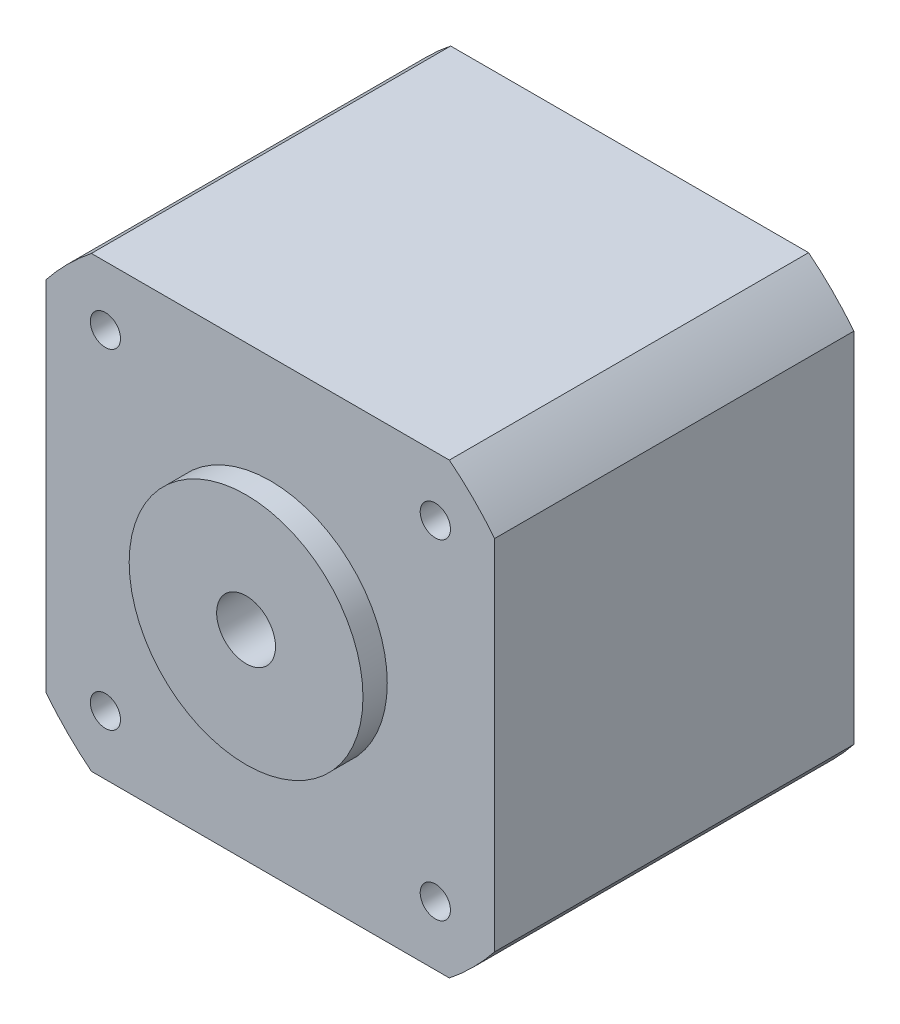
ISO-10303-21;
HEADER;
FILE_DESCRIPTION(('STEP AP214'),'2;1');
FILE_NAME('part.step','',(''),(''),'','','');
FILE_SCHEMA(('AUTOMOTIVE_DESIGN { 1 0 10303 214 1 1 1 1 }'));
ENDSEC;
DATA;
#1=APPLICATION_CONTEXT('core data for automotive mechanical design processes');
#2=APPLICATION_PROTOCOL_DEFINITION('international standard','automotive_design',2000,#1);
#3=PRODUCT_CONTEXT('',#1,'mechanical');
#4=PRODUCT('Part','Part','',(#3));
#5=PRODUCT_RELATED_PRODUCT_CATEGORY('part','',(#4));
#6=PRODUCT_DEFINITION_FORMATION('','',#4);
#7=PRODUCT_DEFINITION_CONTEXT('part definition',#1,'design');
#8=PRODUCT_DEFINITION('design','',#6,#7);
#9=PRODUCT_DEFINITION_SHAPE('','',#8);
#10=(LENGTH_UNIT() NAMED_UNIT(*) SI_UNIT(.MILLI.,.METRE.));
#11=(NAMED_UNIT(*) PLANE_ANGLE_UNIT() SI_UNIT($,.RADIAN.));
#12=(NAMED_UNIT(*) SI_UNIT($,.STERADIAN.) SOLID_ANGLE_UNIT());
#13=UNCERTAINTY_MEASURE_WITH_UNIT(LENGTH_MEASURE(1.E-05),#10,'distance_accuracy_value','');
#14=(GEOMETRIC_REPRESENTATION_CONTEXT(3) GLOBAL_UNCERTAINTY_ASSIGNED_CONTEXT((#13)) GLOBAL_UNIT_ASSIGNED_CONTEXT((#10,
#11,#12)) REPRESENTATION_CONTEXT('',''));
#15=CARTESIAN_POINT('',(0.,0.,0.));
#16=DIRECTION('',(0.,0.,1.));
#17=DIRECTION('',(1.,0.,0.));
#18=AXIS2_PLACEMENT_3D('',#15,#16,#17);
#19=CARTESIAN_POINT('',(-2.25,-17.925,-26.8));
#20=DIRECTION('',(0.,1.,0.));
#21=DIRECTION('',(0.,0.,1.));
#22=AXIS2_PLACEMENT_3D('',#19,#20,#21);
#23=PLANE('',#22);
#24=CARTESIAN_POINT('',(-0.499999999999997,-17.925,-29.05));
#25=DIRECTION('',(0.,1.,0.));
#26=DIRECTION('',(0.,0.,1.));
#27=AXIS2_PLACEMENT_3D('',#24,#25,#26);
#28=CIRCLE('',#27,0.634999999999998);
#29=CARTESIAN_POINT('',(-0.499999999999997,-17.925,-28.415));
#30=VERTEX_POINT('',#29);
#31=EDGE_CURVE('E24',#30,#30,#28,.F.);
#32=ORIENTED_EDGE('',*,*,#31,.F.);
#33=EDGE_LOOP('',(#32));
#34=FACE_BOUND('',#33,.T.);
#35=CARTESIAN_POINT('',(-1.5,-17.925,-28.05));
#36=DIRECTION('',(0.,1.,0.));
#37=DIRECTION('',(0.,0.,1.));
#38=AXIS2_PLACEMENT_3D('',#35,#36,#37);
#39=CIRCLE('',#38,0.634999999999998);
#40=CARTESIAN_POINT('',(-1.5,-17.925,-27.415));
#41=VERTEX_POINT('',#40);
#42=EDGE_CURVE('E239',#41,#41,#39,.F.);
#43=ORIENTED_EDGE('',*,*,#42,.F.);
#44=EDGE_LOOP('',(#43));
#45=FACE_BOUND('',#44,.T.);
#46=DIRECTION('',(0.,0.,-1.));
#47=VECTOR('',#46,1.);
#48=CARTESIAN_POINT('',(-2.25,-17.925,-30.3));
#49=LINE('',#48,#47);
#50=CARTESIAN_POINT('',(-2.25,-17.925,-26.8));
#51=VERTEX_POINT('',#50);
#52=CARTESIAN_POINT('',(-2.25,-17.925,-30.3));
#53=VERTEX_POINT('',#52);
#54=EDGE_CURVE('E107',#51,#53,#49,.T.);
#55=ORIENTED_EDGE('',*,*,#54,.T.);
#56=DIRECTION('',(1.,0.,0.));
#57=VECTOR('',#56,1.);
#58=CARTESIAN_POINT('',(-2.25,-17.925,-30.3));
#59=LINE('',#58,#57);
#60=CARTESIAN_POINT('',(2.25000000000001,-17.925,-30.3));
#61=VERTEX_POINT('',#60);
#62=EDGE_CURVE('E116',#53,#61,#59,.T.);
#63=ORIENTED_EDGE('',*,*,#62,.T.);
#64=DIRECTION('',(0.,0.,1.));
#65=VECTOR('',#64,1.);
#66=CARTESIAN_POINT('',(2.25000000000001,-17.925,-30.3));
#67=LINE('',#66,#65);
#68=CARTESIAN_POINT('',(2.25,-17.925,-26.8));
#69=VERTEX_POINT('',#68);
#70=EDGE_CURVE('E121',#61,#69,#67,.T.);
#71=ORIENTED_EDGE('',*,*,#70,.T.);
#72=DIRECTION('',(-1.,0.,0.));
#73=VECTOR('',#72,1.);
#74=CARTESIAN_POINT('',(-2.25,-17.925,-26.8));
#75=LINE('',#74,#73);
#76=EDGE_CURVE('E113',#69,#51,#75,.T.);
#77=ORIENTED_EDGE('',*,*,#76,.T.);
#78=EDGE_LOOP('',(#55,#63,#71,#77));
#79=FACE_BOUND('',#78,.T.);
#80=CARTESIAN_POINT('',(0.500000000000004,-17.925,-28.05));
#81=DIRECTION('',(0.,1.,0.));
#82=DIRECTION('',(0.,0.,1.));
#83=AXIS2_PLACEMENT_3D('',#80,#81,#82);
#84=CIRCLE('',#83,0.634999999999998);
#85=CARTESIAN_POINT('',(0.500000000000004,-17.925,-27.415));
#86=VERTEX_POINT('',#85);
#87=EDGE_CURVE('E252',#86,#86,#84,.F.);
#88=ORIENTED_EDGE('',*,*,#87,.F.);
#89=EDGE_LOOP('',(#88));
#90=FACE_BOUND('',#89,.T.);
#91=CARTESIAN_POINT('',(1.5,-17.925,-29.05));
#92=DIRECTION('',(0.,1.,0.));
#93=DIRECTION('',(0.,0.,1.));
#94=AXIS2_PLACEMENT_3D('',#91,#92,#93);
#95=CIRCLE('',#94,0.634999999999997);
#96=CARTESIAN_POINT('',(1.5,-17.925,-28.415));
#97=VERTEX_POINT('',#96);
#98=EDGE_CURVE('E11',#97,#97,#95,.F.);
#99=ORIENTED_EDGE('',*,*,#98,.F.);
#100=EDGE_LOOP('',(#99));
#101=FACE_BOUND('',#100,.T.);
#102=ADVANCED_FACE('F16',(#34,#45,#79,#90,#101),#23,.F.);
#103=CARTESIAN_POINT('',(0.,0.,-33.8000000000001));
#104=DIRECTION('',(0.,0.,1.));
#105=DIRECTION('',(1.,0.,0.));
#106=AXIS2_PLACEMENT_3D('',#103,#104,#105);
#107=CYLINDRICAL_SURFACE('',#106,2.7686);
#108=CARTESIAN_POINT('',(0.,0.,2.28600000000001));
#109=DIRECTION('',(0.,0.,1.));
#110=DIRECTION('',(1.,0.,0.));
#111=AXIS2_PLACEMENT_3D('',#108,#109,#110);
#112=CIRCLE('',#111,2.7686);
#113=CARTESIAN_POINT('',(2.7686,0.,2.28600000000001));
#114=VERTEX_POINT('',#113);
#115=EDGE_CURVE('E177',#114,#114,#112,.T.);
#116=ORIENTED_EDGE('',*,*,#115,.T.);
#117=EDGE_LOOP('',(#116));
#118=FACE_BOUND('',#117,.T.);
#119=CARTESIAN_POINT('',(0.,0.,-31.8000000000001));
#120=DIRECTION('',(0.,0.,-1.));
#121=DIRECTION('',(-1.,0.,0.));
#122=AXIS2_PLACEMENT_3D('',#119,#120,#121);
#123=CIRCLE('',#122,2.7686);
#124=CARTESIAN_POINT('',(-2.7686,0.,-31.8000000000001));
#125=VERTEX_POINT('',#124);
#126=EDGE_CURVE('E174',#125,#125,#123,.F.);
#127=ORIENTED_EDGE('',*,*,#126,.F.);
#128=EDGE_LOOP('',(#127));
#129=FACE_BOUND('',#128,.T.);
#130=ADVANCED_FACE('F261',(#118,#129),#107,.F.);
#131=CARTESIAN_POINT('',(-21.1,-21.1,0.));
#132=DIRECTION('',(0.,0.,1.));
#133=DIRECTION('',(1.,0.,0.));
#134=AXIS2_PLACEMENT_3D('',#131,#132,#133);
#135=PLANE('',#134);
#136=CARTESIAN_POINT('',(-15.52,-15.52,0.));
#137=DIRECTION('',(0.,0.,1.));
#138=DIRECTION('',(1.,0.,0.));
#139=AXIS2_PLACEMENT_3D('',#136,#137,#138);
#140=CIRCLE('',#139,1.4224);
#141=CARTESIAN_POINT('',(-14.0976,-15.52,0.));
#142=VERTEX_POINT('',#141);
#143=EDGE_CURVE('E143',#142,#142,#140,.T.);
#144=ORIENTED_EDGE('',*,*,#143,.F.);
#145=EDGE_LOOP('',(#144));
#146=FACE_BOUND('',#145,.T.);
#147=CARTESIAN_POINT('',(15.52,-15.52,0.));
#148=DIRECTION('',(0.,0.,1.));
#149=DIRECTION('',(1.,0.,0.));
#150=AXIS2_PLACEMENT_3D('',#147,#148,#149);
#151=CIRCLE('',#150,1.4224);
#152=CARTESIAN_POINT('',(16.9424,-15.52,0.));
#153=VERTEX_POINT('',#152);
#154=EDGE_CURVE('E150',#153,#153,#151,.T.);
#155=ORIENTED_EDGE('',*,*,#154,.F.);
#156=EDGE_LOOP('',(#155));
#157=FACE_BOUND('',#156,.T.);
#158=CARTESIAN_POINT('',(15.52,15.52,0.));
#159=DIRECTION('',(0.,0.,1.));
#160=DIRECTION('',(1.,0.,0.));
#161=AXIS2_PLACEMENT_3D('',#158,#159,#160);
#162=CIRCLE('',#161,1.4224);
#163=CARTESIAN_POINT('',(16.9424,15.52,0.));
#164=VERTEX_POINT('',#163);
#165=EDGE_CURVE('E156',#164,#164,#162,.T.);
#166=ORIENTED_EDGE('',*,*,#165,.F.);
#167=EDGE_LOOP('',(#166));
#168=FACE_BOUND('',#167,.T.);
#169=CARTESIAN_POINT('',(-15.52,15.52,0.));
#170=DIRECTION('',(0.,0.,1.));
#171=DIRECTION('',(1.,0.,0.));
#172=AXIS2_PLACEMENT_3D('',#169,#170,#171);
#173=CIRCLE('',#172,1.4224);
#174=CARTESIAN_POINT('',(-14.0976,15.52,0.));
#175=VERTEX_POINT('',#174);
#176=EDGE_CURVE('E162',#175,#175,#173,.T.);
#177=ORIENTED_EDGE('',*,*,#176,.F.);
#178=EDGE_LOOP('',(#177));
#179=FACE_BOUND('',#178,.T.);
#180=CARTESIAN_POINT('',(-0.113980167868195,-0.113980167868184,0.));
#181=DIRECTION('',(0.,0.,-1.));
#182=DIRECTION('',(-1.,0.,0.));
#183=AXIS2_PLACEMENT_3D('',#180,#181,#182);
#184=CIRCLE('',#183,26.8351);
#185=CARTESIAN_POINT('',(-16.8385,-21.1,0.));
#186=VERTEX_POINT('',#185);
#187=CARTESIAN_POINT('',(-21.1,-16.8385,0.));
#188=VERTEX_POINT('',#187);
#189=EDGE_CURVE('E184',#186,#188,#184,.T.);
#190=ORIENTED_EDGE('',*,*,#189,.F.);
#191=DIRECTION('',(1.,0.,0.));
#192=VECTOR('',#191,1.);
#193=CARTESIAN_POINT('',(-21.1,-21.1,0.));
#194=LINE('',#193,#192);
#195=CARTESIAN_POINT('',(16.8385,-21.1,0.));
#196=VERTEX_POINT('',#195);
#197=EDGE_CURVE('E242',#186,#196,#194,.T.);
#198=ORIENTED_EDGE('',*,*,#197,.T.);
#199=CARTESIAN_POINT('',(0.113980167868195,-0.113980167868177,0.));
#200=DIRECTION('',(0.,0.,-1.));
#201=DIRECTION('',(1.,0.,0.));
#202=AXIS2_PLACEMENT_3D('',#199,#200,#201);
#203=CIRCLE('',#202,26.8351);
#204=CARTESIAN_POINT('',(21.1,-16.8385,0.));
#205=VERTEX_POINT('',#204);
#206=EDGE_CURVE('E193',#205,#196,#203,.T.);
#207=ORIENTED_EDGE('',*,*,#206,.F.);
#208=DIRECTION('',(0.,1.,0.));
#209=VECTOR('',#208,1.);
#210=CARTESIAN_POINT('',(21.1,21.1,0.));
#211=LINE('',#210,#209);
#212=CARTESIAN_POINT('',(21.1,16.8385,0.));
#213=VERTEX_POINT('',#212);
#214=EDGE_CURVE('E244',#205,#213,#211,.T.);
#215=ORIENTED_EDGE('',*,*,#214,.T.);
#216=CARTESIAN_POINT('',(0.113980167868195,0.113980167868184,0.));
#217=DIRECTION('',(0.,0.,-1.));
#218=DIRECTION('',(-1.,0.,0.));
#219=AXIS2_PLACEMENT_3D('',#216,#217,#218);
#220=CIRCLE('',#219,26.8351);
#221=CARTESIAN_POINT('',(16.8385,21.1,0.));
#222=VERTEX_POINT('',#221);
#223=EDGE_CURVE('E214',#222,#213,#220,.T.);
#224=ORIENTED_EDGE('',*,*,#223,.F.);
#225=DIRECTION('',(-1.,0.,0.));
#226=VECTOR('',#225,1.);
#227=CARTESIAN_POINT('',(-21.1,21.1,0.));
#228=LINE('',#227,#226);
#229=CARTESIAN_POINT('',(-16.8385,21.1,0.));
#230=VERTEX_POINT('',#229);
#231=EDGE_CURVE('E232',#222,#230,#228,.T.);
#232=ORIENTED_EDGE('',*,*,#231,.T.);
#233=CARTESIAN_POINT('',(-0.113980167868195,0.113980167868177,0.));
#234=DIRECTION('',(0.,0.,-1.));
#235=DIRECTION('',(1.,0.,0.));
#236=AXIS2_PLACEMENT_3D('',#233,#234,#235);
#237=CIRCLE('',#236,26.8351);
#238=CARTESIAN_POINT('',(-21.1,16.8385,0.));
#239=VERTEX_POINT('',#238);
#240=EDGE_CURVE('E204',#239,#230,#237,.T.);
#241=ORIENTED_EDGE('',*,*,#240,.F.);
#242=DIRECTION('',(0.,-1.,0.));
#243=VECTOR('',#242,1.);
#244=CARTESIAN_POINT('',(-21.1,21.1,0.));
#245=LINE('',#244,#243);
#246=EDGE_CURVE('E226',#239,#188,#245,.T.);
#247=ORIENTED_EDGE('',*,*,#246,.T.);
#248=EDGE_LOOP('',(#190,#198,#207,#215,#224,#232,#241,#247));
#249=FACE_BOUND('',#248,.T.);
#250=CARTESIAN_POINT('',(0.,0.,0.));
#251=DIRECTION('',(0.,0.,1.));
#252=DIRECTION('',(1.,0.,0.));
#253=AXIS2_PLACEMENT_3D('',#250,#251,#252);
#254=CIRCLE('',#253,10.9982);
#255=CARTESIAN_POINT('',(10.9982,0.,0.));
#256=VERTEX_POINT('',#255);
#257=EDGE_CURVE('E180',#256,#256,#254,.T.);
#258=ORIENTED_EDGE('',*,*,#257,.F.);
#259=EDGE_LOOP('',(#258));
#260=FACE_BOUND('',#259,.T.);
#261=ADVANCED_FACE('F344',(#146,#157,#168,#179,#249,#260),#135,.T.);
#262=CARTESIAN_POINT('',(-21.1,21.1,-33.8000000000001));
#263=DIRECTION('',(-1.,0.,0.));
#264=DIRECTION('',(0.,-1.,0.));
#265=AXIS2_PLACEMENT_3D('',#262,#263,#264);
#266=PLANE('',#265);
#267=DIRECTION('',(0.,0.,1.));
#268=VECTOR('',#267,1.);
#269=CARTESIAN_POINT('',(-21.1,-16.8385,-33.8000000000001));
#270=LINE('',#269,#268);
#271=CARTESIAN_POINT('',(-21.1,-16.8385,-33.8000000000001));
#272=VERTEX_POINT('',#271);
#273=EDGE_CURVE('E190',#272,#188,#270,.T.);
#274=ORIENTED_EDGE('',*,*,#273,.T.);
#275=ORIENTED_EDGE('',*,*,#246,.F.);
#276=DIRECTION('',(0.,0.,1.));
#277=VECTOR('',#276,1.);
#278=CARTESIAN_POINT('',(-21.1,16.8385,-33.8000000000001));
#279=LINE('',#278,#277);
#280=CARTESIAN_POINT('',(-21.1,16.8385,-33.8000000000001));
#281=VERTEX_POINT('',#280);
#282=EDGE_CURVE('E212',#281,#239,#279,.T.);
#283=ORIENTED_EDGE('',*,*,#282,.F.);
#284=DIRECTION('',(0.,-1.,0.));
#285=VECTOR('',#284,1.);
#286=CARTESIAN_POINT('',(-21.1,21.1,-33.8000000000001));
#287=LINE('',#286,#285);
#288=EDGE_CURVE('E228',#281,#272,#287,.T.);
#289=ORIENTED_EDGE('',*,*,#288,.T.);
#290=EDGE_LOOP('',(#274,#275,#283,#289));
#291=FACE_BOUND('',#290,.T.);
#292=ADVANCED_FACE('F18',(#291),#266,.T.);
#293=CARTESIAN_POINT('',(-21.1,21.1,-33.8000000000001));
#294=DIRECTION('',(0.,1.,0.));
#295=DIRECTION('',(0.,0.,1.));
#296=AXIS2_PLACEMENT_3D('',#293,#294,#295);
#297=PLANE('',#296);
#298=DIRECTION('',(0.,0.,1.));
#299=VECTOR('',#298,1.);
#300=CARTESIAN_POINT('',(-16.8385,21.1,-33.8000000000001));
#301=LINE('',#300,#299);
#302=CARTESIAN_POINT('',(-16.8385,21.1,-33.8000000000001));
#303=VERTEX_POINT('',#302);
#304=EDGE_CURVE('E210',#303,#230,#301,.T.);
#305=ORIENTED_EDGE('',*,*,#304,.T.);
#306=ORIENTED_EDGE('',*,*,#231,.F.);
#307=DIRECTION('',(0.,0.,1.));
#308=VECTOR('',#307,1.);
#309=CARTESIAN_POINT('',(16.8385,21.1,-33.8000000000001));
#310=LINE('',#309,#308);
#311=CARTESIAN_POINT('',(16.8385,21.1,-33.8000000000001));
#312=VERTEX_POINT('',#311);
#313=EDGE_CURVE('E220',#312,#222,#310,.T.);
#314=ORIENTED_EDGE('',*,*,#313,.F.);
#315=DIRECTION('',(-1.,0.,0.));
#316=VECTOR('',#315,1.);
#317=CARTESIAN_POINT('',(-21.1,21.1,-33.8000000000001));
#318=LINE('',#317,#316);
#319=EDGE_CURVE('E236',#312,#303,#318,.T.);
#320=ORIENTED_EDGE('',*,*,#319,.T.);
#321=EDGE_LOOP('',(#305,#306,#314,#320));
#322=FACE_BOUND('',#321,.T.);
#323=ADVANCED_FACE('F368',(#322),#297,.T.);
#324=CARTESIAN_POINT('',(21.1,21.1,-33.8000000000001));
#325=DIRECTION('',(1.,0.,0.));
#326=DIRECTION('',(0.,1.,0.));
#327=AXIS2_PLACEMENT_3D('',#324,#325,#326);
#328=PLANE('',#327);
#329=DIRECTION('',(0.,0.,1.));
#330=VECTOR('',#329,1.);
#331=CARTESIAN_POINT('',(21.1,-16.8385,-33.8000000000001));
#332=LINE('',#331,#330);
#333=CARTESIAN_POINT('',(21.1,-16.8385,-33.8000000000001));
#334=VERTEX_POINT('',#333);
#335=EDGE_CURVE('E202',#334,#205,#332,.T.);
#336=ORIENTED_EDGE('',*,*,#335,.F.);
#337=DIRECTION('',(0.,1.,0.));
#338=VECTOR('',#337,1.);
#339=CARTESIAN_POINT('',(21.1,21.1,-33.8000000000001));
#340=LINE('',#339,#338);
#341=CARTESIAN_POINT('',(21.1,16.8385,-33.8000000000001));
#342=VERTEX_POINT('',#341);
#343=EDGE_CURVE('E234',#334,#342,#340,.T.);
#344=ORIENTED_EDGE('',*,*,#343,.T.);
#345=DIRECTION('',(0.,0.,1.));
#346=VECTOR('',#345,1.);
#347=CARTESIAN_POINT('',(21.1,16.8385,-33.8000000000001));
#348=LINE('',#347,#346);
#349=EDGE_CURVE('E223',#342,#213,#348,.T.);
#350=ORIENTED_EDGE('',*,*,#349,.T.);
#351=ORIENTED_EDGE('',*,*,#214,.F.);
#352=EDGE_LOOP('',(#336,#344,#350,#351));
#353=FACE_BOUND('',#352,.T.);
#354=ADVANCED_FACE('F371',(#353),#328,.T.);
#355=CARTESIAN_POINT('',(-21.1,-21.1,-33.8000000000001));
#356=DIRECTION('',(0.,-1.,0.));
#357=DIRECTION('',(0.,0.,-1.));
#358=AXIS2_PLACEMENT_3D('',#355,#356,#357);
#359=PLANE('',#358);
#360=DIRECTION('',(0.,0.,-1.));
#361=VECTOR('',#360,1.);
#362=CARTESIAN_POINT('',(-2.25,-21.1,-30.3));
#363=LINE('',#362,#361);
#364=CARTESIAN_POINT('',(-2.25,-21.1,-26.8));
#365=VERTEX_POINT('',#364);
#366=CARTESIAN_POINT('',(-2.25,-21.1,-30.3));
#367=VERTEX_POINT('',#366);
#368=EDGE_CURVE('E31',#365,#367,#363,.T.);
#369=ORIENTED_EDGE('',*,*,#368,.F.);
#370=DIRECTION('',(-1.,0.,0.));
#371=VECTOR('',#370,1.);
#372=CARTESIAN_POINT('',(-2.25,-21.1,-26.8));
#373=LINE('',#372,#371);
#374=CARTESIAN_POINT('',(2.25,-21.1,-26.8));
#375=VERTEX_POINT('',#374);
#376=EDGE_CURVE('E125',#375,#365,#373,.T.);
#377=ORIENTED_EDGE('',*,*,#376,.F.);
#378=DIRECTION('',(0.,0.,1.));
#379=VECTOR('',#378,1.);
#380=CARTESIAN_POINT('',(2.25000000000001,-21.1,-30.3));
#381=LINE('',#380,#379);
#382=CARTESIAN_POINT('',(2.25000000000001,-21.1,-30.3));
#383=VERTEX_POINT('',#382);
#384=EDGE_CURVE('E128',#383,#375,#381,.T.);
#385=ORIENTED_EDGE('',*,*,#384,.F.);
#386=DIRECTION('',(1.,0.,0.));
#387=VECTOR('',#386,1.);
#388=CARTESIAN_POINT('',(-2.25,-21.1,-30.3));
#389=LINE('',#388,#387);
#390=EDGE_CURVE('E137',#367,#383,#389,.T.);
#391=ORIENTED_EDGE('',*,*,#390,.F.);
#392=EDGE_LOOP('',(#369,#377,#385,#391));
#393=FACE_BOUND('',#392,.T.);
#394=DIRECTION('',(0.,0.,1.));
#395=VECTOR('',#394,1.);
#396=CARTESIAN_POINT('',(-16.8385,-21.1,-33.8000000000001));
#397=LINE('',#396,#395);
#398=CARTESIAN_POINT('',(-16.8385,-21.1,-33.8000000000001));
#399=VERTEX_POINT('',#398);
#400=EDGE_CURVE('E39',#399,#186,#397,.T.);
#401=ORIENTED_EDGE('',*,*,#400,.F.);
#402=DIRECTION('',(1.,0.,0.));
#403=VECTOR('',#402,1.);
#404=CARTESIAN_POINT('',(-21.1,-21.1,-33.8000000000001));
#405=LINE('',#404,#403);
#406=CARTESIAN_POINT('',(16.8385,-21.1,-33.8000000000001));
#407=VERTEX_POINT('',#406);
#408=EDGE_CURVE('E231',#399,#407,#405,.T.);
#409=ORIENTED_EDGE('',*,*,#408,.T.);
#410=DIRECTION('',(0.,0.,1.));
#411=VECTOR('',#410,1.);
#412=CARTESIAN_POINT('',(16.8385,-21.1,-33.8000000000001));
#413=LINE('',#412,#411);
#414=EDGE_CURVE('E199',#407,#196,#413,.T.);
#415=ORIENTED_EDGE('',*,*,#414,.T.);
#416=ORIENTED_EDGE('',*,*,#197,.F.);
#417=EDGE_LOOP('',(#401,#409,#415,#416));
#418=FACE_BOUND('',#417,.T.);
#419=ADVANCED_FACE('F363',(#393,#418),#359,.T.);
#420=CARTESIAN_POINT('',(-21.1,-21.1,-33.8000000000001));
#421=DIRECTION('',(0.,0.,1.));
#422=DIRECTION('',(1.,0.,0.));
#423=AXIS2_PLACEMENT_3D('',#420,#421,#422);
#424=PLANE('',#423);
#425=CARTESIAN_POINT('',(0.,0.,-33.8000000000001));
#426=DIRECTION('',(0.,0.,-1.));
#427=DIRECTION('',(-1.,0.,0.));
#428=AXIS2_PLACEMENT_3D('',#425,#426,#427);
#429=CIRCLE('',#428,4.5);
#430=CARTESIAN_POINT('',(-4.5,0.,-33.8000000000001));
#431=VERTEX_POINT('',#430);
#432=EDGE_CURVE('E168',#431,#431,#429,.T.);
#433=ORIENTED_EDGE('',*,*,#432,.F.);
#434=EDGE_LOOP('',(#433));
#435=FACE_BOUND('',#434,.T.);
#436=ORIENTED_EDGE('',*,*,#408,.F.);
#437=CARTESIAN_POINT('',(-0.113980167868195,-0.113980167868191,-33.8000000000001));
#438=DIRECTION('',(0.,0.,-1.));
#439=DIRECTION('',(-1.,0.,0.));
#440=AXIS2_PLACEMENT_3D('',#437,#438,#439);
#441=CIRCLE('',#440,26.8351);
#442=EDGE_CURVE('E187',#399,#272,#441,.T.);
#443=ORIENTED_EDGE('',*,*,#442,.T.);
#444=ORIENTED_EDGE('',*,*,#288,.F.);
#445=CARTESIAN_POINT('',(-0.113980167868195,0.11398016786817,-33.8000000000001));
#446=DIRECTION('',(0.,0.,-1.));
#447=DIRECTION('',(1.,0.,0.));
#448=AXIS2_PLACEMENT_3D('',#445,#446,#447);
#449=CIRCLE('',#448,26.8351);
#450=EDGE_CURVE('E207',#281,#303,#449,.T.);
#451=ORIENTED_EDGE('',*,*,#450,.T.);
#452=ORIENTED_EDGE('',*,*,#319,.F.);
#453=CARTESIAN_POINT('',(0.113980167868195,0.11398016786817,-33.8000000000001));
#454=DIRECTION('',(0.,0.,-1.));
#455=DIRECTION('',(-1.,0.,0.));
#456=AXIS2_PLACEMENT_3D('',#453,#454,#455);
#457=CIRCLE('',#456,26.8351);
#458=EDGE_CURVE('E217',#312,#342,#457,.T.);
#459=ORIENTED_EDGE('',*,*,#458,.T.);
#460=ORIENTED_EDGE('',*,*,#343,.F.);
#461=CARTESIAN_POINT('',(0.113980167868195,-0.113980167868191,-33.8000000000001));
#462=DIRECTION('',(0.,0.,-1.));
#463=DIRECTION('',(1.,0.,0.));
#464=AXIS2_PLACEMENT_3D('',#461,#462,#463);
#465=CIRCLE('',#464,26.8351);
#466=EDGE_CURVE('E196',#334,#407,#465,.T.);
#467=ORIENTED_EDGE('',*,*,#466,.T.);
#468=EDGE_LOOP('',(#436,#443,#444,#451,#452,#459,#460,#467));
#469=FACE_BOUND('',#468,.T.);
#470=ADVANCED_FACE('F359',(#435,#469),#424,.F.);
#471=CARTESIAN_POINT('',(0.113980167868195,0.11398016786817,-33.8000000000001));
#472=DIRECTION('',(0.,0.,1.));
#473=DIRECTION('',(1.,0.,0.));
#474=AXIS2_PLACEMENT_3D('',#471,#472,#473);
#475=CYLINDRICAL_SURFACE('',#474,26.8351);
#476=ORIENTED_EDGE('',*,*,#223,.T.);
#477=ORIENTED_EDGE('',*,*,#349,.F.);
#478=ORIENTED_EDGE('',*,*,#458,.F.);
#479=ORIENTED_EDGE('',*,*,#313,.T.);
#480=EDGE_LOOP('',(#476,#477,#478,#479));
#481=FACE_BOUND('',#480,.T.);
#482=ADVANCED_FACE('F355',(#481),#475,.T.);
#483=CARTESIAN_POINT('',(-0.113980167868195,0.11398016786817,-33.8000000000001));
#484=DIRECTION('',(0.,0.,1.));
#485=DIRECTION('',(1.,0.,0.));
#486=AXIS2_PLACEMENT_3D('',#483,#484,#485);
#487=CYLINDRICAL_SURFACE('',#486,26.8351);
#488=ORIENTED_EDGE('',*,*,#240,.T.);
#489=ORIENTED_EDGE('',*,*,#304,.F.);
#490=ORIENTED_EDGE('',*,*,#450,.F.);
#491=ORIENTED_EDGE('',*,*,#282,.T.);
#492=EDGE_LOOP('',(#488,#489,#490,#491));
#493=FACE_BOUND('',#492,.T.);
#494=ADVANCED_FACE('F351',(#493),#487,.T.);
#495=CARTESIAN_POINT('',(0.113980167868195,-0.113980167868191,-33.8000000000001));
#496=DIRECTION('',(0.,0.,1.));
#497=DIRECTION('',(1.,0.,0.));
#498=AXIS2_PLACEMENT_3D('',#495,#496,#497);
#499=CYLINDRICAL_SURFACE('',#498,26.8351);
#500=ORIENTED_EDGE('',*,*,#206,.T.);
#501=ORIENTED_EDGE('',*,*,#414,.F.);
#502=ORIENTED_EDGE('',*,*,#466,.F.);
#503=ORIENTED_EDGE('',*,*,#335,.T.);
#504=EDGE_LOOP('',(#500,#501,#502,#503));
#505=FACE_BOUND('',#504,.T.);
#506=ADVANCED_FACE('F348',(#505),#499,.T.);
#507=CARTESIAN_POINT('',(-0.113980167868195,-0.113980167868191,-33.8000000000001));
#508=DIRECTION('',(0.,0.,1.));
#509=DIRECTION('',(1.,0.,0.));
#510=AXIS2_PLACEMENT_3D('',#507,#508,#509);
#511=CYLINDRICAL_SURFACE('',#510,26.8351);
#512=ORIENTED_EDGE('',*,*,#189,.T.);
#513=ORIENTED_EDGE('',*,*,#273,.F.);
#514=ORIENTED_EDGE('',*,*,#442,.F.);
#515=ORIENTED_EDGE('',*,*,#400,.T.);
#516=EDGE_LOOP('',(#512,#513,#514,#515));
#517=FACE_BOUND('',#516,.T.);
#518=ADVANCED_FACE('F337',(#517),#511,.T.);
#519=CARTESIAN_POINT('',(0.,0.,2.28600000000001));
#520=DIRECTION('',(0.,0.,1.));
#521=DIRECTION('',(1.,0.,0.));
#522=AXIS2_PLACEMENT_3D('',#519,#520,#521);
#523=PLANE('',#522);
#524=CARTESIAN_POINT('',(0.,0.,2.28600000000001));
#525=DIRECTION('',(0.,0.,1.));
#526=DIRECTION('',(1.,0.,0.));
#527=AXIS2_PLACEMENT_3D('',#524,#525,#526);
#528=CIRCLE('',#527,10.9982);
#529=CARTESIAN_POINT('',(10.9982,0.,2.28600000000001));
#530=VERTEX_POINT('',#529);
#531=EDGE_CURVE('E181',#530,#530,#528,.T.);
#532=ORIENTED_EDGE('',*,*,#531,.T.);
#533=EDGE_LOOP('',(#532));
#534=FACE_BOUND('',#533,.T.);
#535=ORIENTED_EDGE('',*,*,#115,.F.);
#536=EDGE_LOOP('',(#535));
#537=FACE_BOUND('',#536,.T.);
#538=ADVANCED_FACE('F334',(#534,#537),#523,.T.);
#539=CARTESIAN_POINT('',(0.,0.,2.28600000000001));
#540=DIRECTION('',(0.,0.,-1.));
#541=DIRECTION('',(-1.,0.,0.));
#542=AXIS2_PLACEMENT_3D('',#539,#540,#541);
#543=CYLINDRICAL_SURFACE('',#542,10.9982);
#544=ORIENTED_EDGE('',*,*,#531,.F.);
#545=EDGE_LOOP('',(#544));
#546=FACE_BOUND('',#545,.T.);
#547=ORIENTED_EDGE('',*,*,#257,.T.);
#548=EDGE_LOOP('',(#547));
#549=FACE_BOUND('',#548,.T.);
#550=ADVANCED_FACE('F329',(#546,#549),#543,.T.);
#551=CARTESIAN_POINT('',(0.,0.,-31.8000000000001));
#552=DIRECTION('',(0.,0.,-1.));
#553=DIRECTION('',(-1.,0.,0.));
#554=AXIS2_PLACEMENT_3D('',#551,#552,#553);
#555=PLANE('',#554);
#556=CARTESIAN_POINT('',(0.,0.,-31.8000000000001));
#557=DIRECTION('',(0.,0.,-1.));
#558=DIRECTION('',(-1.,0.,0.));
#559=AXIS2_PLACEMENT_3D('',#556,#557,#558);
#560=CIRCLE('',#559,4.5);
#561=CARTESIAN_POINT('',(-4.5,0.,-31.8000000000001));
#562=VERTEX_POINT('',#561);
#563=EDGE_CURVE('E171',#562,#562,#560,.T.);
#564=ORIENTED_EDGE('',*,*,#563,.T.);
#565=EDGE_LOOP('',(#564));
#566=FACE_BOUND('',#565,.T.);
#567=ORIENTED_EDGE('',*,*,#126,.T.);
#568=EDGE_LOOP('',(#567));
#569=FACE_BOUND('',#568,.T.);
#570=ADVANCED_FACE('F326',(#566,#569),#555,.T.);
#571=CARTESIAN_POINT('',(0.,0.,-31.8000000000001));
#572=DIRECTION('',(0.,0.,-1.));
#573=DIRECTION('',(-1.,0.,0.));
#574=AXIS2_PLACEMENT_3D('',#571,#572,#573);
#575=CYLINDRICAL_SURFACE('',#574,4.5);
#576=ORIENTED_EDGE('',*,*,#563,.F.);
#577=EDGE_LOOP('',(#576));
#578=FACE_BOUND('',#577,.T.);
#579=ORIENTED_EDGE('',*,*,#432,.T.);
#580=EDGE_LOOP('',(#579));
#581=FACE_BOUND('',#580,.T.);
#582=ADVANCED_FACE('F324',(#578,#581),#575,.F.);
#583=CARTESIAN_POINT('',(-15.52,15.52,-3.80999999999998));
#584=DIRECTION('',(0.,0.,1.));
#585=DIRECTION('',(1.,0.,0.));
#586=AXIS2_PLACEMENT_3D('',#583,#584,#585);
#587=CYLINDRICAL_SURFACE('',#586,1.4224);
#588=CARTESIAN_POINT('',(-15.52,15.52,-3.80999999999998));
#589=DIRECTION('',(0.,0.,1.));
#590=DIRECTION('',(1.,0.,0.));
#591=AXIS2_PLACEMENT_3D('',#588,#589,#590);
#592=CIRCLE('',#591,1.4224);
#593=CARTESIAN_POINT('',(-14.0976,15.52,-3.80999999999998));
#594=VERTEX_POINT('',#593);
#595=EDGE_CURVE('E165',#594,#594,#592,.T.);
#596=ORIENTED_EDGE('',*,*,#595,.F.);
#597=EDGE_LOOP('',(#596));
#598=FACE_BOUND('',#597,.T.);
#599=ORIENTED_EDGE('',*,*,#176,.T.);
#600=EDGE_LOOP('',(#599));
#601=FACE_BOUND('',#600,.T.);
#602=ADVANCED_FACE('F320',(#598,#601),#587,.F.);
#603=CARTESIAN_POINT('',(-15.52,15.52,-3.80999999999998));
#604=DIRECTION('',(0.,0.,1.));
#605=DIRECTION('',(1.,0.,0.));
#606=AXIS2_PLACEMENT_3D('',#603,#604,#605);
#607=PLANE('',#606);
#608=ORIENTED_EDGE('',*,*,#595,.T.);
#609=EDGE_LOOP('',(#608));
#610=FACE_BOUND('',#609,.T.);
#611=ADVANCED_FACE('F316',(#610),#607,.T.);
#612=CARTESIAN_POINT('',(15.52,15.52,-3.80999999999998));
#613=DIRECTION('',(0.,0.,1.));
#614=DIRECTION('',(1.,0.,0.));
#615=AXIS2_PLACEMENT_3D('',#612,#613,#614);
#616=CYLINDRICAL_SURFACE('',#615,1.4224);
#617=CARTESIAN_POINT('',(15.52,15.52,-3.80999999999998));
#618=DIRECTION('',(0.,0.,1.));
#619=DIRECTION('',(1.,0.,0.));
#620=AXIS2_PLACEMENT_3D('',#617,#618,#619);
#621=CIRCLE('',#620,1.4224);
#622=CARTESIAN_POINT('',(16.9424,15.52,-3.80999999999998));
#623=VERTEX_POINT('',#622);
#624=EDGE_CURVE('E159',#623,#623,#621,.T.);
#625=ORIENTED_EDGE('',*,*,#624,.F.);
#626=EDGE_LOOP('',(#625));
#627=FACE_BOUND('',#626,.T.);
#628=ORIENTED_EDGE('',*,*,#165,.T.);
#629=EDGE_LOOP('',(#628));
#630=FACE_BOUND('',#629,.T.);
#631=ADVANCED_FACE('F312',(#627,#630),#616,.F.);
#632=CARTESIAN_POINT('',(15.52,15.52,-3.80999999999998));
#633=DIRECTION('',(0.,0.,1.));
#634=DIRECTION('',(1.,0.,0.));
#635=AXIS2_PLACEMENT_3D('',#632,#633,#634);
#636=PLANE('',#635);
#637=ORIENTED_EDGE('',*,*,#624,.T.);
#638=EDGE_LOOP('',(#637));
#639=FACE_BOUND('',#638,.T.);
#640=ADVANCED_FACE('F308',(#639),#636,.T.);
#641=CARTESIAN_POINT('',(15.52,-15.52,-3.80999999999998));
#642=DIRECTION('',(0.,0.,1.));
#643=DIRECTION('',(1.,0.,0.));
#644=AXIS2_PLACEMENT_3D('',#641,#642,#643);
#645=CYLINDRICAL_SURFACE('',#644,1.4224);
#646=CARTESIAN_POINT('',(15.52,-15.52,-3.80999999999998));
#647=DIRECTION('',(0.,0.,1.));
#648=DIRECTION('',(1.,0.,0.));
#649=AXIS2_PLACEMENT_3D('',#646,#647,#648);
#650=CIRCLE('',#649,1.4224);
#651=CARTESIAN_POINT('',(16.9424,-15.52,-3.80999999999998));
#652=VERTEX_POINT('',#651);
#653=EDGE_CURVE('E153',#652,#652,#650,.T.);
#654=ORIENTED_EDGE('',*,*,#653,.F.);
#655=EDGE_LOOP('',(#654));
#656=FACE_BOUND('',#655,.T.);
#657=ORIENTED_EDGE('',*,*,#154,.T.);
#658=EDGE_LOOP('',(#657));
#659=FACE_BOUND('',#658,.T.);
#660=ADVANCED_FACE('F304',(#656,#659),#645,.F.);
#661=CARTESIAN_POINT('',(15.52,-15.52,-3.80999999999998));
#662=DIRECTION('',(0.,0.,1.));
#663=DIRECTION('',(1.,0.,0.));
#664=AXIS2_PLACEMENT_3D('',#661,#662,#663);
#665=PLANE('',#664);
#666=ORIENTED_EDGE('',*,*,#653,.T.);
#667=EDGE_LOOP('',(#666));
#668=FACE_BOUND('',#667,.T.);
#669=ADVANCED_FACE('F300',(#668),#665,.T.);
#670=CARTESIAN_POINT('',(-15.52,-15.52,-3.80999999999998));
#671=DIRECTION('',(0.,0.,1.));
#672=DIRECTION('',(1.,0.,0.));
#673=AXIS2_PLACEMENT_3D('',#670,#671,#672);
#674=CYLINDRICAL_SURFACE('',#673,1.4224);
#675=CARTESIAN_POINT('',(-15.52,-15.52,-3.80999999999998));
#676=DIRECTION('',(0.,0.,1.));
#677=DIRECTION('',(1.,0.,0.));
#678=AXIS2_PLACEMENT_3D('',#675,#676,#677);
#679=CIRCLE('',#678,1.4224);
#680=CARTESIAN_POINT('',(-14.0976,-15.52,-3.80999999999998));
#681=VERTEX_POINT('',#680);
#682=EDGE_CURVE('E147',#681,#681,#679,.T.);
#683=ORIENTED_EDGE('',*,*,#682,.F.);
#684=EDGE_LOOP('',(#683));
#685=FACE_BOUND('',#684,.T.);
#686=ORIENTED_EDGE('',*,*,#143,.T.);
#687=EDGE_LOOP('',(#686));
#688=FACE_BOUND('',#687,.T.);
#689=ADVANCED_FACE('F296',(#685,#688),#674,.F.);
#690=CARTESIAN_POINT('',(-15.52,-15.52,-3.80999999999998));
#691=DIRECTION('',(0.,0.,1.));
#692=DIRECTION('',(1.,0.,0.));
#693=AXIS2_PLACEMENT_3D('',#690,#691,#692);
#694=PLANE('',#693);
#695=ORIENTED_EDGE('',*,*,#682,.T.);
#696=EDGE_LOOP('',(#695));
#697=FACE_BOUND('',#696,.T.);
#698=ADVANCED_FACE('F293',(#697),#694,.T.);
#699=CARTESIAN_POINT('',(-2.25,-17.925,-30.3));
#700=DIRECTION('',(-1.,0.,0.));
#701=DIRECTION('',(0.,0.,1.));
#702=AXIS2_PLACEMENT_3D('',#699,#700,#701);
#703=PLANE('',#702);
#704=ORIENTED_EDGE('',*,*,#368,.T.);
#705=DIRECTION('',(0.,-1.,0.));
#706=VECTOR('',#705,1.);
#707=CARTESIAN_POINT('',(-2.25,-17.925,-30.3));
#708=LINE('',#707,#706);
#709=EDGE_CURVE('E103',#53,#367,#708,.T.);
#710=ORIENTED_EDGE('',*,*,#709,.F.);
#711=ORIENTED_EDGE('',*,*,#54,.F.);
#712=DIRECTION('',(0.,-1.,0.));
#713=VECTOR('',#712,1.);
#714=CARTESIAN_POINT('',(-2.25,-17.925,-26.8));
#715=LINE('',#714,#713);
#716=EDGE_CURVE('E141',#51,#365,#715,.T.);
#717=ORIENTED_EDGE('',*,*,#716,.T.);
#718=EDGE_LOOP('',(#704,#710,#711,#717));
#719=FACE_BOUND('',#718,.T.);
#720=ADVANCED_FACE('F105',(#719),#703,.F.);
#721=CARTESIAN_POINT('',(-2.25,-17.925,-26.8));
#722=DIRECTION('',(0.,0.,1.));
#723=DIRECTION('',(1.,0.,0.));
#724=AXIS2_PLACEMENT_3D('',#721,#722,#723);
#725=PLANE('',#724);
#726=ORIENTED_EDGE('',*,*,#376,.T.);
#727=ORIENTED_EDGE('',*,*,#716,.F.);
#728=ORIENTED_EDGE('',*,*,#76,.F.);
#729=DIRECTION('',(0.,-1.,0.));
#730=VECTOR('',#729,1.);
#731=CARTESIAN_POINT('',(2.25,-17.925,-26.8));
#732=LINE('',#731,#730);
#733=EDGE_CURVE('E144',#69,#375,#732,.T.);
#734=ORIENTED_EDGE('',*,*,#733,.T.);
#735=EDGE_LOOP('',(#726,#727,#728,#734));
#736=FACE_BOUND('',#735,.T.);
#737=ADVANCED_FACE('F284',(#736),#725,.F.);
#738=CARTESIAN_POINT('',(2.25000000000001,-17.925,-30.3));
#739=DIRECTION('',(1.,0.,0.));
#740=DIRECTION('',(0.,0.,-1.));
#741=AXIS2_PLACEMENT_3D('',#738,#739,#740);
#742=PLANE('',#741);
#743=ORIENTED_EDGE('',*,*,#384,.T.);
#744=ORIENTED_EDGE('',*,*,#733,.F.);
#745=ORIENTED_EDGE('',*,*,#70,.F.);
#746=DIRECTION('',(0.,-1.,0.));
#747=VECTOR('',#746,1.);
#748=CARTESIAN_POINT('',(2.25000000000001,-17.925,-30.3));
#749=LINE('',#748,#747);
#750=EDGE_CURVE('E112',#61,#383,#749,.T.);
#751=ORIENTED_EDGE('',*,*,#750,.T.);
#752=EDGE_LOOP('',(#743,#744,#745,#751));
#753=FACE_BOUND('',#752,.T.);
#754=ADVANCED_FACE('F279',(#753),#742,.F.);
#755=CARTESIAN_POINT('',(-2.25,-17.925,-30.3));
#756=DIRECTION('',(0.,0.,-1.));
#757=DIRECTION('',(-1.,0.,0.));
#758=AXIS2_PLACEMENT_3D('',#755,#756,#757);
#759=PLANE('',#758);
#760=ORIENTED_EDGE('',*,*,#390,.T.);
#761=ORIENTED_EDGE('',*,*,#750,.F.);
#762=ORIENTED_EDGE('',*,*,#62,.F.);
#763=ORIENTED_EDGE('',*,*,#709,.T.);
#764=EDGE_LOOP('',(#760,#761,#762,#763));
#765=FACE_BOUND('',#764,.T.);
#766=ADVANCED_FACE('F117',(#765),#759,.F.);
#767=CARTESIAN_POINT('',(-1.5,-32.925,-28.05));
#768=DIRECTION('',(0.,1.,0.));
#769=DIRECTION('',(0.,0.,1.));
#770=AXIS2_PLACEMENT_3D('',#767,#768,#769);
#771=CYLINDRICAL_SURFACE('',#770,0.634999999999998);
#772=CARTESIAN_POINT('',(-1.5,-32.925,-28.05));
#773=DIRECTION('',(0.,-1.,0.));
#774=DIRECTION('',(0.,0.,-1.));
#775=AXIS2_PLACEMENT_3D('',#772,#773,#774);
#776=CIRCLE('',#775,0.634999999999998);
#777=CARTESIAN_POINT('',(-1.5,-32.925,-28.685));
#778=VERTEX_POINT('',#777);
#779=EDGE_CURVE('E131',#778,#778,#776,.T.);
#780=ORIENTED_EDGE('',*,*,#779,.F.);
#781=EDGE_LOOP('',(#780));
#782=FACE_BOUND('',#781,.T.);
#783=ORIENTED_EDGE('',*,*,#42,.T.);
#784=EDGE_LOOP('',(#783));
#785=FACE_BOUND('',#784,.T.);
#786=ADVANCED_FACE('F265',(#782,#785),#771,.T.);
#787=CARTESIAN_POINT('',(-1.5,-32.925,-28.05));
#788=DIRECTION('',(0.,-1.,0.));
#789=DIRECTION('',(0.,0.,-1.));
#790=AXIS2_PLACEMENT_3D('',#787,#788,#789);
#791=PLANE('',#790);
#792=ORIENTED_EDGE('',*,*,#779,.T.);
#793=EDGE_LOOP('',(#792));
#794=FACE_BOUND('',#793,.T.);
#795=ADVANCED_FACE('F267',(#794),#791,.T.);
#796=CARTESIAN_POINT('',(0.500000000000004,-32.925,-28.05));
#797=DIRECTION('',(0.,1.,0.));
#798=DIRECTION('',(0.,0.,1.));
#799=AXIS2_PLACEMENT_3D('',#796,#797,#798);
#800=CYLINDRICAL_SURFACE('',#799,0.634999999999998);
#801=CARTESIAN_POINT('',(0.500000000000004,-32.925,-28.05));
#802=DIRECTION('',(0.,-1.,0.));
#803=DIRECTION('',(0.,0.,-1.));
#804=AXIS2_PLACEMENT_3D('',#801,#802,#803);
#805=CIRCLE('',#804,0.634999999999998);
#806=CARTESIAN_POINT('',(0.500000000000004,-32.925,-28.685));
#807=VERTEX_POINT('',#806);
#808=EDGE_CURVE('E760',#807,#807,#805,.T.);
#809=ORIENTED_EDGE('',*,*,#808,.F.);
#810=EDGE_LOOP('',(#809));
#811=FACE_BOUND('',#810,.T.);
#812=ORIENTED_EDGE('',*,*,#87,.T.);
#813=EDGE_LOOP('',(#812));
#814=FACE_BOUND('',#813,.T.);
#815=ADVANCED_FACE('F276',(#811,#814),#800,.T.);
#816=CARTESIAN_POINT('',(0.500000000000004,-32.925,-28.05));
#817=DIRECTION('',(0.,-1.,0.));
#818=DIRECTION('',(0.,0.,-1.));
#819=AXIS2_PLACEMENT_3D('',#816,#817,#818);
#820=PLANE('',#819);
#821=ORIENTED_EDGE('',*,*,#808,.T.);
#822=EDGE_LOOP('',(#821));
#823=FACE_BOUND('',#822,.T.);
#824=ADVANCED_FACE('F596',(#823),#820,.T.);
#825=CARTESIAN_POINT('',(-0.499999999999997,-32.925,-29.05));
#826=DIRECTION('',(0.,1.,0.));
#827=DIRECTION('',(0.,0.,1.));
#828=AXIS2_PLACEMENT_3D('',#825,#826,#827);
#829=CYLINDRICAL_SURFACE('',#828,0.634999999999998);
#830=CARTESIAN_POINT('',(-0.499999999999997,-32.925,-29.05));
#831=DIRECTION('',(0.,-1.,0.));
#832=DIRECTION('',(0.,0.,-1.));
#833=AXIS2_PLACEMENT_3D('',#830,#831,#832);
#834=CIRCLE('',#833,0.634999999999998);
#835=CARTESIAN_POINT('',(-0.499999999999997,-32.925,-29.685));
#836=VERTEX_POINT('',#835);
#837=EDGE_CURVE('E757',#836,#836,#834,.T.);
#838=ORIENTED_EDGE('',*,*,#837,.F.);
#839=EDGE_LOOP('',(#838));
#840=FACE_BOUND('',#839,.T.);
#841=ORIENTED_EDGE('',*,*,#31,.T.);
#842=EDGE_LOOP('',(#841));
#843=FACE_BOUND('',#842,.T.);
#844=ADVANCED_FACE('F257',(#840,#843),#829,.T.);
#845=CARTESIAN_POINT('',(-0.499999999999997,-32.925,-29.05));
#846=DIRECTION('',(0.,-1.,0.));
#847=DIRECTION('',(0.,0.,-1.));
#848=AXIS2_PLACEMENT_3D('',#845,#846,#847);
#849=PLANE('',#848);
#850=ORIENTED_EDGE('',*,*,#837,.T.);
#851=EDGE_LOOP('',(#850));
#852=FACE_BOUND('',#851,.T.);
#853=ADVANCED_FACE('F616',(#852),#849,.T.);
#854=CARTESIAN_POINT('',(1.50000000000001,-32.925,-29.05));
#855=DIRECTION('',(0.,1.,0.));
#856=DIRECTION('',(0.,0.,1.));
#857=AXIS2_PLACEMENT_3D('',#854,#855,#856);
#858=CYLINDRICAL_SURFACE('',#857,0.634999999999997);
#859=CARTESIAN_POINT('',(1.50000000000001,-32.925,-29.05));
#860=DIRECTION('',(0.,-1.,0.));
#861=DIRECTION('',(0.,0.,-1.));
#862=AXIS2_PLACEMENT_3D('',#859,#860,#861);
#863=CIRCLE('',#862,0.634999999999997);
#864=CARTESIAN_POINT('',(1.50000000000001,-32.925,-29.685));
#865=VERTEX_POINT('',#864);
#866=EDGE_CURVE('E756',#865,#865,#863,.T.);
#867=ORIENTED_EDGE('',*,*,#866,.F.);
#868=EDGE_LOOP('',(#867));
#869=FACE_BOUND('',#868,.T.);
#870=ORIENTED_EDGE('',*,*,#98,.T.);
#871=EDGE_LOOP('',(#870));
#872=FACE_BOUND('',#871,.T.);
#873=ADVANCED_FACE('F627',(#869,#872),#858,.T.);
#874=CARTESIAN_POINT('',(1.50000000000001,-32.925,-29.05));
#875=DIRECTION('',(0.,-1.,0.));
#876=DIRECTION('',(0.,0.,-1.));
#877=AXIS2_PLACEMENT_3D('',#874,#875,#876);
#878=PLANE('',#877);
#879=ORIENTED_EDGE('',*,*,#866,.T.);
#880=EDGE_LOOP('',(#879));
#881=FACE_BOUND('',#880,.T.);
#882=ADVANCED_FACE('F638',(#881),#878,.T.);
#883=CLOSED_SHELL('',(#102,#130,#261,#292,#323,#354,#419,#470,#482,#494,#506,#518,#538,#550,
#570,#582,#602,#611,#631,#640,#660,#669,#689,#698,#720,#737,#754,#766,#786,#795,#815,#824,#844,
#853,#873,#882));
#884=MANIFOLD_SOLID_BREP('B1',#883);
#885=ADVANCED_BREP_SHAPE_REPRESENTATION('',(#18,#884),#14);
#886=SHAPE_DEFINITION_REPRESENTATION(#9,#885);
ENDSEC;
END-ISO-10303-21;
